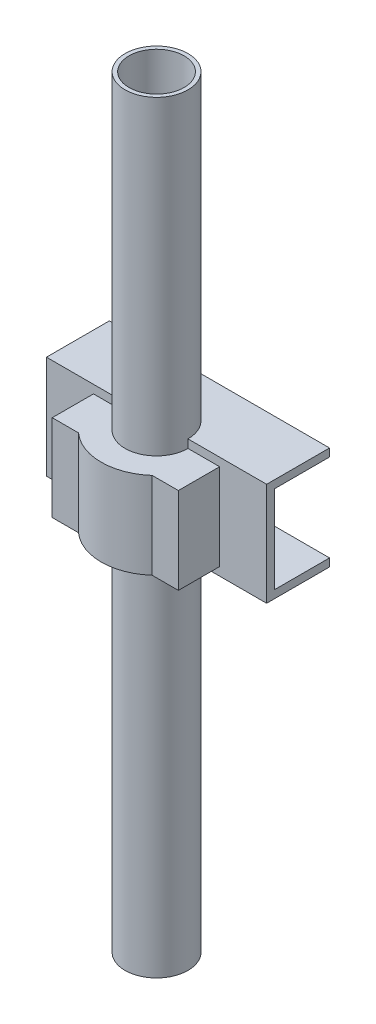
ISO-10303-21;
HEADER;
FILE_DESCRIPTION(('STEP AP214'),'2;1');
FILE_NAME('part.step','',(''),(''),'','','');
FILE_SCHEMA(('AUTOMOTIVE_DESIGN { 1 0 10303 214 1 1 1 1 }'));
ENDSEC;
DATA;
#1=APPLICATION_CONTEXT('core data for automotive mechanical design processes');
#2=APPLICATION_PROTOCOL_DEFINITION('international standard','automotive_design',2000,#1);
#3=PRODUCT_CONTEXT('',#1,'mechanical');
#4=PRODUCT('Part','Part','',(#3));
#5=PRODUCT_RELATED_PRODUCT_CATEGORY('part','',(#4));
#6=PRODUCT_DEFINITION_FORMATION('','',#4);
#7=PRODUCT_DEFINITION_CONTEXT('part definition',#1,'design');
#8=PRODUCT_DEFINITION('design','',#6,#7);
#9=PRODUCT_DEFINITION_SHAPE('','',#8);
#10=(LENGTH_UNIT() NAMED_UNIT(*) SI_UNIT(.MILLI.,.METRE.));
#11=(NAMED_UNIT(*) PLANE_ANGLE_UNIT() SI_UNIT($,.RADIAN.));
#12=(NAMED_UNIT(*) SI_UNIT($,.STERADIAN.) SOLID_ANGLE_UNIT());
#13=UNCERTAINTY_MEASURE_WITH_UNIT(LENGTH_MEASURE(1.E-05),#10,'distance_accuracy_value','');
#14=(GEOMETRIC_REPRESENTATION_CONTEXT(3) GLOBAL_UNCERTAINTY_ASSIGNED_CONTEXT((#13)) GLOBAL_UNIT_ASSIGNED_CONTEXT((#10,
#11,#12)) REPRESENTATION_CONTEXT('',''));
#15=CARTESIAN_POINT('',(0.,0.,0.));
#16=DIRECTION('',(0.,0.,1.));
#17=DIRECTION('',(1.,0.,0.));
#18=AXIS2_PLACEMENT_3D('',#15,#16,#17);
#19=CARTESIAN_POINT('',(14.,6.555,4.));
#20=DIRECTION('',(0.,0.,-1.));
#21=DIRECTION('',(0.,1.,0.));
#22=AXIS2_PLACEMENT_3D('',#19,#20,#21);
#23=PLANE('',#22);
#24=DIRECTION('',(-1.,0.,0.));
#25=VECTOR('',#24,1.);
#26=CARTESIAN_POINT('',(-8.02128804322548,5.5,4.));
#27=LINE('',#26,#25);
#28=CARTESIAN_POINT('',(-4.,5.49999999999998,4.00000000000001));
#29=VERTEX_POINT('',#28);
#30=CARTESIAN_POINT('',(-8.02128804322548,5.5,4.));
#31=VERTEX_POINT('',#30);
#32=EDGE_CURVE('E208',#29,#31,#27,.T.);
#33=ORIENTED_EDGE('',*,*,#32,.F.);
#34=DIRECTION('',(0.,1.,0.));
#35=VECTOR('',#34,1.);
#36=CARTESIAN_POINT('',(-4.,-52.,4.00000000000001));
#37=LINE('',#36,#35);
#38=CARTESIAN_POINT('',(-4.,6.55500000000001,4.));
#39=VERTEX_POINT('',#38);
#40=EDGE_CURVE('E237',#29,#39,#37,.T.);
#41=ORIENTED_EDGE('',*,*,#40,.T.);
#42=DIRECTION('',(-1.,0.,0.));
#43=VECTOR('',#42,1.);
#44=CARTESIAN_POINT('',(14.,6.555,4.));
#45=LINE('',#44,#43);
#46=CARTESIAN_POINT('',(-14.,6.555,4.));
#47=VERTEX_POINT('',#46);
#48=EDGE_CURVE('E280',#39,#47,#45,.T.);
#49=ORIENTED_EDGE('',*,*,#48,.T.);
#50=DIRECTION('',(0.,-1.,0.));
#51=VECTOR('',#50,1.);
#52=CARTESIAN_POINT('',(-14.,6.555,4.));
#53=LINE('',#52,#51);
#54=CARTESIAN_POINT('',(-14.,-6.555,4.));
#55=VERTEX_POINT('',#54);
#56=EDGE_CURVE('E243',#47,#55,#53,.T.);
#57=ORIENTED_EDGE('',*,*,#56,.T.);
#58=DIRECTION('',(-1.,0.,0.));
#59=VECTOR('',#58,1.);
#60=CARTESIAN_POINT('',(14.,-6.555,4.));
#61=LINE('',#60,#59);
#62=CARTESIAN_POINT('',(-4.,-6.555,4.00000000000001));
#63=VERTEX_POINT('',#62);
#64=EDGE_CURVE('E299',#63,#55,#61,.T.);
#65=ORIENTED_EDGE('',*,*,#64,.F.);
#66=CARTESIAN_POINT('',(-4.,-5.50000000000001,4.00000000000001));
#67=VERTEX_POINT('',#66);
#68=EDGE_CURVE('E238',#63,#67,#37,.T.);
#69=ORIENTED_EDGE('',*,*,#68,.T.);
#70=DIRECTION('',(-1.,0.,0.));
#71=VECTOR('',#70,1.);
#72=CARTESIAN_POINT('',(-8.02128804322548,-5.5,4.));
#73=LINE('',#72,#71);
#74=CARTESIAN_POINT('',(-8.02128804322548,-5.5,4.));
#75=VERTEX_POINT('',#74);
#76=EDGE_CURVE('E52',#67,#75,#73,.T.);
#77=ORIENTED_EDGE('',*,*,#76,.T.);
#78=DIRECTION('',(0.,-1.,0.));
#79=VECTOR('',#78,1.);
#80=CARTESIAN_POINT('',(-8.02128804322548,5.5,4.));
#81=LINE('',#80,#79);
#82=EDGE_CURVE('E47',#31,#75,#81,.T.);
#83=ORIENTED_EDGE('',*,*,#82,.F.);
#84=EDGE_LOOP('',(#33,#41,#49,#57,#65,#69,#77,#83));
#85=FACE_BOUND('',#84,.T.);
#86=ADVANCED_FACE('F33',(#85),#23,.F.);
#87=DIRECTION('',(-1.,0.,0.));
#88=VECTOR('',#87,1.);
#89=CARTESIAN_POINT('',(8.02128804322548,5.5,4.));
#90=LINE('',#89,#88);
#91=CARTESIAN_POINT('',(8.02128804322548,5.5,4.));
#92=VERTEX_POINT('',#91);
#93=CARTESIAN_POINT('',(4.,5.49999999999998,4.00000000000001));
#94=VERTEX_POINT('',#93);
#95=EDGE_CURVE('E202',#92,#94,#90,.T.);
#96=ORIENTED_EDGE('',*,*,#95,.F.);
#97=DIRECTION('',(0.,-1.,0.));
#98=VECTOR('',#97,1.);
#99=CARTESIAN_POINT('',(8.02128804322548,5.5,4.));
#100=LINE('',#99,#98);
#101=CARTESIAN_POINT('',(8.02128804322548,-5.5,4.));
#102=VERTEX_POINT('',#101);
#103=EDGE_CURVE('E219',#92,#102,#100,.T.);
#104=ORIENTED_EDGE('',*,*,#103,.T.);
#105=DIRECTION('',(-1.,0.,0.));
#106=VECTOR('',#105,1.);
#107=CARTESIAN_POINT('',(8.02128804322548,-5.5,4.));
#108=LINE('',#107,#106);
#109=CARTESIAN_POINT('',(4.,-5.5,4.));
#110=VERTEX_POINT('',#109);
#111=EDGE_CURVE('E186',#102,#110,#108,.T.);
#112=ORIENTED_EDGE('',*,*,#111,.T.);
#113=DIRECTION('',(0.,1.,0.));
#114=VECTOR('',#113,1.);
#115=CARTESIAN_POINT('',(4.,-52.,4.00000000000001));
#116=LINE('',#115,#114);
#117=CARTESIAN_POINT('',(4.,-6.555,4.00000000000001));
#118=VERTEX_POINT('',#117);
#119=EDGE_CURVE('E233',#110,#118,#116,.F.);
#120=ORIENTED_EDGE('',*,*,#119,.T.);
#121=CARTESIAN_POINT('',(14.,-6.555,4.));
#122=VERTEX_POINT('',#121);
#123=EDGE_CURVE('E40',#122,#118,#61,.T.);
#124=ORIENTED_EDGE('',*,*,#123,.F.);
#125=DIRECTION('',(0.,-1.,0.));
#126=VECTOR('',#125,1.);
#127=CARTESIAN_POINT('',(14.,6.555,4.));
#128=LINE('',#127,#126);
#129=CARTESIAN_POINT('',(14.,6.555,4.));
#130=VERTEX_POINT('',#129);
#131=EDGE_CURVE('E263',#130,#122,#128,.T.);
#132=ORIENTED_EDGE('',*,*,#131,.F.);
#133=CARTESIAN_POINT('',(4.,6.55500000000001,4.));
#134=VERTEX_POINT('',#133);
#135=EDGE_CURVE('E281',#130,#134,#45,.T.);
#136=ORIENTED_EDGE('',*,*,#135,.T.);
#137=EDGE_CURVE('E234',#134,#94,#116,.F.);
#138=ORIENTED_EDGE('',*,*,#137,.T.);
#139=EDGE_LOOP('',(#96,#104,#112,#120,#124,#132,#136,#138));
#140=FACE_BOUND('',#139,.T.);
#141=ADVANCED_FACE('F348',(#140),#23,.F.);
#142=CARTESIAN_POINT('',(0.,-52.,4.));
#143=DIRECTION('',(0.,1.,0.));
#144=DIRECTION('',(0.,0.,1.));
#145=AXIS2_PLACEMENT_3D('',#142,#143,#144);
#146=CYLINDRICAL_SURFACE('',#145,4.);
#147=CARTESIAN_POINT('',(0.,45.,4.));
#148=DIRECTION('',(0.,1.,0.));
#149=DIRECTION('',(0.,0.,1.));
#150=AXIS2_PLACEMENT_3D('',#147,#148,#149);
#151=CIRCLE('',#150,4.);
#152=CARTESIAN_POINT('',(0.,45.,8.));
#153=VERTEX_POINT('',#152);
#154=EDGE_CURVE('E227',#153,#153,#151,.T.);
#155=ORIENTED_EDGE('',*,*,#154,.F.);
#156=EDGE_LOOP('',(#155));
#157=FACE_BOUND('',#156,.T.);
#158=ORIENTED_EDGE('',*,*,#40,.F.);
#159=CARTESIAN_POINT('',(0.,5.5,4.));
#160=DIRECTION('',(0.,-1.,0.));
#161=DIRECTION('',(0.,0.,1.));
#162=AXIS2_PLACEMENT_3D('',#159,#160,#161);
#163=CIRCLE('',#162,4.);
#164=EDGE_CURVE('E205',#94,#29,#163,.T.);
#165=ORIENTED_EDGE('',*,*,#164,.F.);
#166=ORIENTED_EDGE('',*,*,#137,.F.);
#167=CARTESIAN_POINT('',(0.,6.55500000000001,4.));
#168=DIRECTION('',(0.,-1.,0.));
#169=DIRECTION('',(0.,0.,-1.));
#170=AXIS2_PLACEMENT_3D('',#167,#168,#169);
#171=CIRCLE('',#170,4.);
#172=EDGE_CURVE('E11',#39,#134,#171,.T.);
#173=ORIENTED_EDGE('',*,*,#172,.F.);
#174=EDGE_LOOP('',(#158,#165,#166,#173));
#175=FACE_BOUND('',#174,.T.);
#176=ADVANCED_FACE('F364',(#157,#175),#146,.T.);
#177=CARTESIAN_POINT('',(14.,-6.555,4.));
#178=DIRECTION('',(0.,1.,0.));
#179=DIRECTION('',(0.,0.,1.));
#180=AXIS2_PLACEMENT_3D('',#177,#178,#179);
#181=PLANE('',#180);
#182=ORIENTED_EDGE('',*,*,#123,.T.);
#183=CARTESIAN_POINT('',(0.,-6.555,4.));
#184=DIRECTION('',(0.,1.,0.));
#185=DIRECTION('',(0.,0.,1.));
#186=AXIS2_PLACEMENT_3D('',#183,#184,#185);
#187=CIRCLE('',#186,4.);
#188=EDGE_CURVE('E240',#118,#63,#187,.T.);
#189=ORIENTED_EDGE('',*,*,#188,.T.);
#190=ORIENTED_EDGE('',*,*,#64,.T.);
#191=DIRECTION('',(0.,0.,-1.));
#192=VECTOR('',#191,1.);
#193=CARTESIAN_POINT('',(-14.,-6.555,4.));
#194=LINE('',#193,#192);
#195=CARTESIAN_POINT('',(-14.,-6.555,-4.00000000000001));
#196=VERTEX_POINT('',#195);
#197=EDGE_CURVE('E246',#55,#196,#194,.T.);
#198=ORIENTED_EDGE('',*,*,#197,.T.);
#199=DIRECTION('',(-1.,0.,0.));
#200=VECTOR('',#199,1.);
#201=CARTESIAN_POINT('',(14.,-6.555,-4.00000000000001));
#202=LINE('',#201,#200);
#203=CARTESIAN_POINT('',(14.,-6.555,-4.00000000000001));
#204=VERTEX_POINT('',#203);
#205=EDGE_CURVE('E297',#204,#196,#202,.T.);
#206=ORIENTED_EDGE('',*,*,#205,.F.);
#207=DIRECTION('',(0.,0.,-1.));
#208=VECTOR('',#207,1.);
#209=CARTESIAN_POINT('',(14.,-6.555,4.));
#210=LINE('',#209,#208);
#211=EDGE_CURVE('E266',#122,#204,#210,.T.);
#212=ORIENTED_EDGE('',*,*,#211,.F.);
#213=EDGE_LOOP('',(#182,#189,#190,#198,#206,#212));
#214=FACE_BOUND('',#213,.T.);
#215=ADVANCED_FACE('F305',(#214),#181,.F.);
#216=CARTESIAN_POINT('',(14.,-6.555,-4.00000000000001));
#217=DIRECTION('',(0.,0.,1.));
#218=DIRECTION('',(0.,-1.,0.));
#219=AXIS2_PLACEMENT_3D('',#216,#217,#218);
#220=PLANE('',#219);
#221=DIRECTION('',(0.,1.,0.));
#222=VECTOR('',#221,1.);
#223=CARTESIAN_POINT('',(-14.,-6.555,-4.00000000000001));
#224=LINE('',#223,#222);
#225=CARTESIAN_POINT('',(-14.,-5.555,-4.));
#226=VERTEX_POINT('',#225);
#227=EDGE_CURVE('E248',#196,#226,#224,.T.);
#228=ORIENTED_EDGE('',*,*,#227,.T.);
#229=DIRECTION('',(-1.,0.,0.));
#230=VECTOR('',#229,1.);
#231=CARTESIAN_POINT('',(14.,-5.555,-4.));
#232=LINE('',#231,#230);
#233=CARTESIAN_POINT('',(14.,-5.555,-4.));
#234=VERTEX_POINT('',#233);
#235=EDGE_CURVE('E294',#234,#226,#232,.T.);
#236=ORIENTED_EDGE('',*,*,#235,.F.);
#237=DIRECTION('',(0.,1.,0.));
#238=VECTOR('',#237,1.);
#239=CARTESIAN_POINT('',(14.,-6.555,-4.00000000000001));
#240=LINE('',#239,#238);
#241=EDGE_CURVE('E268',#204,#234,#240,.T.);
#242=ORIENTED_EDGE('',*,*,#241,.F.);
#243=ORIENTED_EDGE('',*,*,#205,.T.);
#244=EDGE_LOOP('',(#228,#236,#242,#243));
#245=FACE_BOUND('',#244,.T.);
#246=ADVANCED_FACE('F342',(#245),#220,.F.);
#247=CARTESIAN_POINT('',(14.,-5.555,2.99999999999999));
#248=DIRECTION('',(0.,-1.,0.));
#249=DIRECTION('',(0.,0.,-1.));
#250=AXIS2_PLACEMENT_3D('',#247,#248,#249);
#251=PLANE('',#250);
#252=DIRECTION('',(0.,0.,1.));
#253=VECTOR('',#252,1.);
#254=CARTESIAN_POINT('',(-14.,-5.555,2.99999999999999));
#255=LINE('',#254,#253);
#256=CARTESIAN_POINT('',(-14.,-5.555,2.99999999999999));
#257=VERTEX_POINT('',#256);
#258=EDGE_CURVE('E250',#226,#257,#255,.T.);
#259=ORIENTED_EDGE('',*,*,#258,.T.);
#260=DIRECTION('',(-1.,0.,0.));
#261=VECTOR('',#260,1.);
#262=CARTESIAN_POINT('',(14.,-5.555,2.99999999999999));
#263=LINE('',#262,#261);
#264=CARTESIAN_POINT('',(14.,-5.555,2.99999999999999));
#265=VERTEX_POINT('',#264);
#266=EDGE_CURVE('E292',#265,#257,#263,.T.);
#267=ORIENTED_EDGE('',*,*,#266,.F.);
#268=DIRECTION('',(0.,0.,1.));
#269=VECTOR('',#268,1.);
#270=CARTESIAN_POINT('',(14.,-5.555,2.99999999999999));
#271=LINE('',#270,#269);
#272=EDGE_CURVE('E270',#234,#265,#271,.T.);
#273=ORIENTED_EDGE('',*,*,#272,.F.);
#274=ORIENTED_EDGE('',*,*,#235,.T.);
#275=EDGE_LOOP('',(#259,#267,#273,#274));
#276=FACE_BOUND('',#275,.T.);
#277=ADVANCED_FACE('F337',(#276),#251,.F.);
#278=CARTESIAN_POINT('',(14.,5.555,2.99999999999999));
#279=DIRECTION('',(0.,0.,1.));
#280=DIRECTION('',(0.,-1.,0.));
#281=AXIS2_PLACEMENT_3D('',#278,#279,#280);
#282=PLANE('',#281);
#283=DIRECTION('',(0.,1.,0.));
#284=VECTOR('',#283,1.);
#285=CARTESIAN_POINT('',(-14.,5.555,2.99999999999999));
#286=LINE('',#285,#284);
#287=CARTESIAN_POINT('',(-14.,5.555,2.99999999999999));
#288=VERTEX_POINT('',#287);
#289=EDGE_CURVE('E253',#257,#288,#286,.T.);
#290=ORIENTED_EDGE('',*,*,#289,.T.);
#291=DIRECTION('',(-1.,0.,0.));
#292=VECTOR('',#291,1.);
#293=CARTESIAN_POINT('',(14.,5.555,2.99999999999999));
#294=LINE('',#293,#292);
#295=CARTESIAN_POINT('',(14.,5.555,2.99999999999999));
#296=VERTEX_POINT('',#295);
#297=EDGE_CURVE('E290',#296,#288,#294,.T.);
#298=ORIENTED_EDGE('',*,*,#297,.F.);
#299=DIRECTION('',(0.,1.,0.));
#300=VECTOR('',#299,1.);
#301=CARTESIAN_POINT('',(14.,5.555,2.99999999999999));
#302=LINE('',#301,#300);
#303=EDGE_CURVE('E272',#265,#296,#302,.T.);
#304=ORIENTED_EDGE('',*,*,#303,.F.);
#305=ORIENTED_EDGE('',*,*,#266,.T.);
#306=EDGE_LOOP('',(#290,#298,#304,#305));
#307=FACE_BOUND('',#306,.T.);
#308=ADVANCED_FACE('F334',(#307),#282,.F.);
#309=CARTESIAN_POINT('',(14.,5.555,-4.));
#310=DIRECTION('',(0.,1.,0.));
#311=DIRECTION('',(0.,0.,1.));
#312=AXIS2_PLACEMENT_3D('',#309,#310,#311);
#313=PLANE('',#312);
#314=ORIENTED_EDGE('',*,*,#297,.T.);
#315=DIRECTION('',(0.,0.,-1.));
#316=VECTOR('',#315,1.);
#317=CARTESIAN_POINT('',(-14.,5.555,-4.));
#318=LINE('',#317,#316);
#319=CARTESIAN_POINT('',(-14.,5.555,-4.));
#320=VERTEX_POINT('',#319);
#321=EDGE_CURVE('E256',#288,#320,#318,.T.);
#322=ORIENTED_EDGE('',*,*,#321,.T.);
#323=DIRECTION('',(-1.,0.,0.));
#324=VECTOR('',#323,1.);
#325=CARTESIAN_POINT('',(14.,5.555,-4.));
#326=LINE('',#325,#324);
#327=CARTESIAN_POINT('',(14.,5.555,-4.));
#328=VERTEX_POINT('',#327);
#329=EDGE_CURVE('E287',#328,#320,#326,.T.);
#330=ORIENTED_EDGE('',*,*,#329,.F.);
#331=DIRECTION('',(0.,0.,-1.));
#332=VECTOR('',#331,1.);
#333=CARTESIAN_POINT('',(14.,5.555,-4.));
#334=LINE('',#333,#332);
#335=EDGE_CURVE('E274',#296,#328,#334,.T.);
#336=ORIENTED_EDGE('',*,*,#335,.F.);
#337=EDGE_LOOP('',(#314,#322,#330,#336));
#338=FACE_BOUND('',#337,.T.);
#339=ADVANCED_FACE('F330',(#338),#313,.F.);
#340=CARTESIAN_POINT('',(14.,5.555,-4.));
#341=DIRECTION('',(0.,0.,1.));
#342=DIRECTION('',(0.,-1.,0.));
#343=AXIS2_PLACEMENT_3D('',#340,#341,#342);
#344=PLANE('',#343);
#345=DIRECTION('',(0.,1.,0.));
#346=VECTOR('',#345,1.);
#347=CARTESIAN_POINT('',(-14.,5.555,-4.));
#348=LINE('',#347,#346);
#349=CARTESIAN_POINT('',(-14.,6.555,-4.));
#350=VERTEX_POINT('',#349);
#351=EDGE_CURVE('E258',#320,#350,#348,.T.);
#352=ORIENTED_EDGE('',*,*,#351,.T.);
#353=DIRECTION('',(-1.,0.,0.));
#354=VECTOR('',#353,1.);
#355=CARTESIAN_POINT('',(14.,6.555,-4.));
#356=LINE('',#355,#354);
#357=CARTESIAN_POINT('',(14.,6.555,-4.));
#358=VERTEX_POINT('',#357);
#359=EDGE_CURVE('E284',#358,#350,#356,.T.);
#360=ORIENTED_EDGE('',*,*,#359,.F.);
#361=DIRECTION('',(0.,1.,0.));
#362=VECTOR('',#361,1.);
#363=CARTESIAN_POINT('',(14.,5.555,-4.));
#364=LINE('',#363,#362);
#365=EDGE_CURVE('E276',#328,#358,#364,.T.);
#366=ORIENTED_EDGE('',*,*,#365,.F.);
#367=ORIENTED_EDGE('',*,*,#329,.T.);
#368=EDGE_LOOP('',(#352,#360,#366,#367));
#369=FACE_BOUND('',#368,.T.);
#370=ADVANCED_FACE('F325',(#369),#344,.F.);
#371=CARTESIAN_POINT('',(14.,6.555,-4.));
#372=DIRECTION('',(0.,-1.,0.));
#373=DIRECTION('',(0.,0.,-1.));
#374=AXIS2_PLACEMENT_3D('',#371,#372,#373);
#375=PLANE('',#374);
#376=ORIENTED_EDGE('',*,*,#48,.F.);
#377=ORIENTED_EDGE('',*,*,#172,.T.);
#378=ORIENTED_EDGE('',*,*,#135,.F.);
#379=DIRECTION('',(0.,0.,1.));
#380=VECTOR('',#379,1.);
#381=CARTESIAN_POINT('',(14.,6.555,-4.));
#382=LINE('',#381,#380);
#383=EDGE_CURVE('E278',#358,#130,#382,.T.);
#384=ORIENTED_EDGE('',*,*,#383,.F.);
#385=ORIENTED_EDGE('',*,*,#359,.T.);
#386=DIRECTION('',(0.,0.,1.));
#387=VECTOR('',#386,1.);
#388=CARTESIAN_POINT('',(-14.,6.555,-4.));
#389=LINE('',#388,#387);
#390=EDGE_CURVE('E260',#350,#47,#389,.T.);
#391=ORIENTED_EDGE('',*,*,#390,.T.);
#392=EDGE_LOOP('',(#376,#377,#378,#384,#385,#391));
#393=FACE_BOUND('',#392,.T.);
#394=ADVANCED_FACE('F318',(#393),#375,.F.);
#395=CARTESIAN_POINT('',(14.,-5.555,4.));
#396=DIRECTION('',(1.,0.,0.));
#397=DIRECTION('',(0.,0.,-1.));
#398=AXIS2_PLACEMENT_3D('',#395,#396,#397);
#399=PLANE('',#398);
#400=ORIENTED_EDGE('',*,*,#131,.T.);
#401=ORIENTED_EDGE('',*,*,#211,.T.);
#402=ORIENTED_EDGE('',*,*,#241,.T.);
#403=ORIENTED_EDGE('',*,*,#272,.T.);
#404=ORIENTED_EDGE('',*,*,#303,.T.);
#405=ORIENTED_EDGE('',*,*,#335,.T.);
#406=ORIENTED_EDGE('',*,*,#365,.T.);
#407=ORIENTED_EDGE('',*,*,#383,.T.);
#408=EDGE_LOOP('',(#400,#401,#402,#403,#404,#405,#406,#407));
#409=FACE_BOUND('',#408,.T.);
#410=ADVANCED_FACE('F345',(#409),#399,.T.);
#411=CARTESIAN_POINT('',(-14.,-5.555,4.));
#412=DIRECTION('',(1.,0.,0.));
#413=DIRECTION('',(0.,0.,-1.));
#414=AXIS2_PLACEMENT_3D('',#411,#412,#413);
#415=PLANE('',#414);
#416=ORIENTED_EDGE('',*,*,#56,.F.);
#417=ORIENTED_EDGE('',*,*,#390,.F.);
#418=ORIENTED_EDGE('',*,*,#351,.F.);
#419=ORIENTED_EDGE('',*,*,#321,.F.);
#420=ORIENTED_EDGE('',*,*,#289,.F.);
#421=ORIENTED_EDGE('',*,*,#258,.F.);
#422=ORIENTED_EDGE('',*,*,#227,.F.);
#423=ORIENTED_EDGE('',*,*,#197,.F.);
#424=EDGE_LOOP('',(#416,#417,#418,#419,#420,#421,#422,#423));
#425=FACE_BOUND('',#424,.T.);
#426=ADVANCED_FACE('F311',(#425),#415,.F.);
#427=CARTESIAN_POINT('',(0.,45.,4.));
#428=DIRECTION('',(0.,1.,0.));
#429=DIRECTION('',(0.,0.,1.));
#430=AXIS2_PLACEMENT_3D('',#427,#428,#429);
#431=PLANE('',#430);
#432=CARTESIAN_POINT('',(0.,45.,4.));
#433=DIRECTION('',(0.,1.,0.));
#434=DIRECTION('',(0.,0.,1.));
#435=AXIS2_PLACEMENT_3D('',#432,#433,#434);
#436=CIRCLE('',#435,3.5);
#437=CARTESIAN_POINT('',(0.,45.,7.5));
#438=VERTEX_POINT('',#437);
#439=EDGE_CURVE('E176',#438,#438,#436,.T.);
#440=ORIENTED_EDGE('',*,*,#439,.F.);
#441=EDGE_LOOP('',(#440));
#442=FACE_BOUND('',#441,.T.);
#443=ORIENTED_EDGE('',*,*,#154,.T.);
#444=EDGE_LOOP('',(#443));
#445=FACE_BOUND('',#444,.T.);
#446=ADVANCED_FACE('F402',(#442,#445),#431,.T.);
#447=CARTESIAN_POINT('',(0.,-52.,4.));
#448=DIRECTION('',(0.,1.,0.));
#449=DIRECTION('',(0.,0.,1.));
#450=AXIS2_PLACEMENT_3D('',#447,#448,#449);
#451=PLANE('',#450);
#452=CARTESIAN_POINT('',(0.,-52.,4.));
#453=DIRECTION('',(0.,1.,0.));
#454=DIRECTION('',(0.,0.,1.));
#455=AXIS2_PLACEMENT_3D('',#452,#453,#454);
#456=CIRCLE('',#455,4.);
#457=CARTESIAN_POINT('',(0.,-52.,8.));
#458=VERTEX_POINT('',#457);
#459=EDGE_CURVE('E230',#458,#458,#456,.T.);
#460=ORIENTED_EDGE('',*,*,#459,.F.);
#461=EDGE_LOOP('',(#460));
#462=FACE_BOUND('',#461,.T.);
#463=ADVANCED_FACE('F394',(#462),#451,.F.);
#464=CARTESIAN_POINT('',(0.,-5.5,4.));
#465=DIRECTION('',(0.,-1.,0.));
#466=DIRECTION('',(0.,0.,1.));
#467=AXIS2_PLACEMENT_3D('',#464,#465,#466);
#468=CIRCLE('',#467,4.);
#469=EDGE_CURVE('E189',#110,#67,#468,.T.);
#470=ORIENTED_EDGE('',*,*,#469,.T.);
#471=ORIENTED_EDGE('',*,*,#68,.F.);
#472=ORIENTED_EDGE('',*,*,#188,.F.);
#473=ORIENTED_EDGE('',*,*,#119,.F.);
#474=EDGE_LOOP('',(#470,#471,#472,#473));
#475=FACE_BOUND('',#474,.T.);
#476=ORIENTED_EDGE('',*,*,#459,.T.);
#477=EDGE_LOOP('',(#476));
#478=FACE_BOUND('',#477,.T.);
#479=ADVANCED_FACE('F351',(#475,#478),#146,.T.);
#480=CARTESIAN_POINT('',(14.,7.555,-4.));
#481=DIRECTION('',(0.,-1.,0.));
#482=DIRECTION('',(0.,0.,-1.));
#483=AXIS2_PLACEMENT_3D('',#480,#481,#482);
#484=PLANE('',#483);
#485=CARTESIAN_POINT('',(0.,7.555,4.));
#486=DIRECTION('',(0.,-1.,0.));
#487=DIRECTION('',(0.,0.,-1.));
#488=AXIS2_PLACEMENT_3D('',#485,#486,#487);
#489=CIRCLE('',#488,3.5);
#490=CARTESIAN_POINT('',(0.,7.555,0.5));
#491=VERTEX_POINT('',#490);
#492=EDGE_CURVE('E224',#491,#491,#489,.F.);
#493=ORIENTED_EDGE('',*,*,#492,.T.);
#494=EDGE_LOOP('',(#493));
#495=FACE_BOUND('',#494,.T.);
#496=ADVANCED_FACE('F393',(#495),#484,.F.);
#497=CARTESIAN_POINT('',(0.,-3.34449493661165,4.));
#498=DIRECTION('',(0.,1.,0.));
#499=DIRECTION('',(0.,0.,1.));
#500=AXIS2_PLACEMENT_3D('',#497,#498,#499);
#501=CYLINDRICAL_SURFACE('',#500,3.5);
#502=ORIENTED_EDGE('',*,*,#439,.T.);
#503=EDGE_LOOP('',(#502));
#504=FACE_BOUND('',#503,.T.);
#505=ORIENTED_EDGE('',*,*,#492,.F.);
#506=EDGE_LOOP('',(#505));
#507=FACE_BOUND('',#506,.T.);
#508=ADVANCED_FACE('F399',(#504,#507),#501,.F.);
#509=CARTESIAN_POINT('',(0.,5.5,4.));
#510=DIRECTION('',(0.,-1.,0.));
#511=DIRECTION('',(0.,0.,-1.));
#512=AXIS2_PLACEMENT_3D('',#509,#510,#511);
#513=CYLINDRICAL_SURFACE('',#512,7.03288657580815);
#514=CARTESIAN_POINT('',(0.,-5.5,4.));
#515=DIRECTION('',(0.,1.,0.));
#516=DIRECTION('',(0.,0.,-1.));
#517=AXIS2_PLACEMENT_3D('',#514,#515,#516);
#518=CIRCLE('',#517,7.03288657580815);
#519=CARTESIAN_POINT('',(-4.68468468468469,-5.5,9.24549549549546));
#520=VERTEX_POINT('',#519);
#521=CARTESIAN_POINT('',(4.68468468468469,-5.5,9.24549549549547));
#522=VERTEX_POINT('',#521);
#523=EDGE_CURVE('E161',#520,#522,#518,.T.);
#524=ORIENTED_EDGE('',*,*,#523,.T.);
#525=DIRECTION('',(0.,-1.,0.));
#526=VECTOR('',#525,1.);
#527=CARTESIAN_POINT('',(4.68468468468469,5.5,9.24549549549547));
#528=LINE('',#527,#526);
#529=CARTESIAN_POINT('',(4.68468468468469,5.5,9.24549549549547));
#530=VERTEX_POINT('',#529);
#531=EDGE_CURVE('E170',#530,#522,#528,.T.);
#532=ORIENTED_EDGE('',*,*,#531,.F.);
#533=CARTESIAN_POINT('',(0.,5.5,4.));
#534=DIRECTION('',(0.,1.,0.));
#535=DIRECTION('',(0.,0.,-1.));
#536=AXIS2_PLACEMENT_3D('',#533,#534,#535);
#537=CIRCLE('',#536,7.03288657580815);
#538=CARTESIAN_POINT('',(-4.68468468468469,5.5,9.24549549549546));
#539=VERTEX_POINT('',#538);
#540=EDGE_CURVE('E196',#539,#530,#537,.T.);
#541=ORIENTED_EDGE('',*,*,#540,.F.);
#542=DIRECTION('',(0.,-1.,0.));
#543=VECTOR('',#542,1.);
#544=CARTESIAN_POINT('',(-4.68468468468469,5.5,9.24549549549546));
#545=LINE('',#544,#543);
#546=EDGE_CURVE('E182',#539,#520,#545,.T.);
#547=ORIENTED_EDGE('',*,*,#546,.T.);
#548=EDGE_LOOP('',(#524,#532,#541,#547));
#549=FACE_BOUND('',#548,.T.);
#550=ADVANCED_FACE('F180',(#549),#513,.T.);
#551=CARTESIAN_POINT('',(8.02128804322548,5.5,9.24549549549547));
#552=DIRECTION('',(0.,0.,-1.));
#553=DIRECTION('',(-1.,0.,0.));
#554=AXIS2_PLACEMENT_3D('',#551,#552,#553);
#555=PLANE('',#554);
#556=DIRECTION('',(1.,0.,0.));
#557=VECTOR('',#556,1.);
#558=CARTESIAN_POINT('',(8.02128804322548,-5.5,9.24549549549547));
#559=LINE('',#558,#557);
#560=CARTESIAN_POINT('',(8.02128804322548,-5.5,9.24549549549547));
#561=VERTEX_POINT('',#560);
#562=EDGE_CURVE('E156',#522,#561,#559,.T.);
#563=ORIENTED_EDGE('',*,*,#562,.T.);
#564=DIRECTION('',(0.,-1.,0.));
#565=VECTOR('',#564,1.);
#566=CARTESIAN_POINT('',(8.02128804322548,5.5,9.24549549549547));
#567=LINE('',#566,#565);
#568=CARTESIAN_POINT('',(8.02128804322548,5.5,9.24549549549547));
#569=VERTEX_POINT('',#568);
#570=EDGE_CURVE('E177',#569,#561,#567,.T.);
#571=ORIENTED_EDGE('',*,*,#570,.F.);
#572=DIRECTION('',(1.,0.,0.));
#573=VECTOR('',#572,1.);
#574=CARTESIAN_POINT('',(8.02128804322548,5.5,9.24549549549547));
#575=LINE('',#574,#573);
#576=EDGE_CURVE('E172',#530,#569,#575,.T.);
#577=ORIENTED_EDGE('',*,*,#576,.F.);
#578=ORIENTED_EDGE('',*,*,#531,.T.);
#579=EDGE_LOOP('',(#563,#571,#577,#578));
#580=FACE_BOUND('',#579,.T.);
#581=ADVANCED_FACE('F171',(#580),#555,.F.);
#582=CARTESIAN_POINT('',(8.02128804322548,5.5,4.));
#583=DIRECTION('',(-1.,0.,0.));
#584=DIRECTION('',(0.,0.,1.));
#585=AXIS2_PLACEMENT_3D('',#582,#583,#584);
#586=PLANE('',#585);
#587=DIRECTION('',(0.,0.,-1.));
#588=VECTOR('',#587,1.);
#589=CARTESIAN_POINT('',(8.02128804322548,-5.5,4.));
#590=LINE('',#589,#588);
#591=EDGE_CURVE('E164',#561,#102,#590,.T.);
#592=ORIENTED_EDGE('',*,*,#591,.T.);
#593=ORIENTED_EDGE('',*,*,#103,.F.);
#594=DIRECTION('',(0.,0.,-1.));
#595=VECTOR('',#594,1.);
#596=CARTESIAN_POINT('',(8.02128804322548,5.5,4.));
#597=LINE('',#596,#595);
#598=EDGE_CURVE('E199',#569,#92,#597,.T.);
#599=ORIENTED_EDGE('',*,*,#598,.F.);
#600=ORIENTED_EDGE('',*,*,#570,.T.);
#601=EDGE_LOOP('',(#592,#593,#599,#600));
#602=FACE_BOUND('',#601,.T.);
#603=ADVANCED_FACE('F368',(#602),#586,.F.);
#604=CARTESIAN_POINT('',(-8.02128804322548,5.5,4.));
#605=DIRECTION('',(1.,0.,0.));
#606=DIRECTION('',(0.,0.,-1.));
#607=AXIS2_PLACEMENT_3D('',#604,#605,#606);
#608=PLANE('',#607);
#609=DIRECTION('',(0.,0.,1.));
#610=VECTOR('',#609,1.);
#611=CARTESIAN_POINT('',(-8.02128804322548,-5.5,4.));
#612=LINE('',#611,#610);
#613=CARTESIAN_POINT('',(-8.02128804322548,-5.5,9.24549549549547));
#614=VERTEX_POINT('',#613);
#615=EDGE_CURVE('E192',#75,#614,#612,.T.);
#616=ORIENTED_EDGE('',*,*,#615,.T.);
#617=DIRECTION('',(0.,-1.,0.));
#618=VECTOR('',#617,1.);
#619=CARTESIAN_POINT('',(-8.02128804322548,5.5,9.24549549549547));
#620=LINE('',#619,#618);
#621=CARTESIAN_POINT('',(-8.02128804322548,5.5,9.24549549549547));
#622=VERTEX_POINT('',#621);
#623=EDGE_CURVE('E215',#622,#614,#620,.T.);
#624=ORIENTED_EDGE('',*,*,#623,.F.);
#625=DIRECTION('',(0.,0.,1.));
#626=VECTOR('',#625,1.);
#627=CARTESIAN_POINT('',(-8.02128804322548,5.5,4.));
#628=LINE('',#627,#626);
#629=EDGE_CURVE('E210',#31,#622,#628,.T.);
#630=ORIENTED_EDGE('',*,*,#629,.F.);
#631=ORIENTED_EDGE('',*,*,#82,.T.);
#632=EDGE_LOOP('',(#616,#624,#630,#631));
#633=FACE_BOUND('',#632,.T.);
#634=ADVANCED_FACE('F356',(#633),#608,.F.);
#635=CARTESIAN_POINT('',(-8.02128804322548,5.5,9.24549549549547));
#636=DIRECTION('',(0.,0.,-1.));
#637=DIRECTION('',(-1.,0.,0.));
#638=AXIS2_PLACEMENT_3D('',#635,#636,#637);
#639=PLANE('',#638);
#640=DIRECTION('',(1.,0.,0.));
#641=VECTOR('',#640,1.);
#642=CARTESIAN_POINT('',(-8.02128804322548,-5.5,9.24549549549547));
#643=LINE('',#642,#641);
#644=EDGE_CURVE('E194',#614,#520,#643,.T.);
#645=ORIENTED_EDGE('',*,*,#644,.T.);
#646=ORIENTED_EDGE('',*,*,#546,.F.);
#647=DIRECTION('',(1.,0.,0.));
#648=VECTOR('',#647,1.);
#649=CARTESIAN_POINT('',(-8.02128804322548,5.5,9.24549549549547));
#650=LINE('',#649,#648);
#651=EDGE_CURVE('E212',#622,#539,#650,.T.);
#652=ORIENTED_EDGE('',*,*,#651,.F.);
#653=ORIENTED_EDGE('',*,*,#623,.T.);
#654=EDGE_LOOP('',(#645,#646,#652,#653));
#655=FACE_BOUND('',#654,.T.);
#656=ADVANCED_FACE('F360',(#655),#639,.F.);
#657=CARTESIAN_POINT('',(0.,5.5,4.));
#658=DIRECTION('',(0.,-1.,0.));
#659=DIRECTION('',(0.,0.,-1.));
#660=AXIS2_PLACEMENT_3D('',#657,#658,#659);
#661=PLANE('',#660);
#662=ORIENTED_EDGE('',*,*,#540,.T.);
#663=ORIENTED_EDGE('',*,*,#576,.T.);
#664=ORIENTED_EDGE('',*,*,#598,.T.);
#665=ORIENTED_EDGE('',*,*,#95,.T.);
#666=ORIENTED_EDGE('',*,*,#164,.T.);
#667=ORIENTED_EDGE('',*,*,#32,.T.);
#668=ORIENTED_EDGE('',*,*,#629,.T.);
#669=ORIENTED_EDGE('',*,*,#651,.T.);
#670=EDGE_LOOP('',(#662,#663,#664,#665,#666,#667,#668,#669));
#671=FACE_BOUND('',#670,.T.);
#672=ADVANCED_FACE('F362',(#671),#661,.F.);
#673=CARTESIAN_POINT('',(0.,-5.5,4.));
#674=DIRECTION('',(0.,-1.,0.));
#675=DIRECTION('',(0.,0.,-1.));
#676=AXIS2_PLACEMENT_3D('',#673,#674,#675);
#677=PLANE('',#676);
#678=ORIENTED_EDGE('',*,*,#523,.F.);
#679=ORIENTED_EDGE('',*,*,#644,.F.);
#680=ORIENTED_EDGE('',*,*,#615,.F.);
#681=ORIENTED_EDGE('',*,*,#76,.F.);
#682=ORIENTED_EDGE('',*,*,#469,.F.);
#683=ORIENTED_EDGE('',*,*,#111,.F.);
#684=ORIENTED_EDGE('',*,*,#591,.F.);
#685=ORIENTED_EDGE('',*,*,#562,.F.);
#686=EDGE_LOOP('',(#678,#679,#680,#681,#682,#683,#684,#685));
#687=FACE_BOUND('',#686,.T.);
#688=ADVANCED_FACE('F158',(#687),#677,.T.);
#689=CLOSED_SHELL('',(#86,#141,#176,#215,#246,#277,#308,#339,#370,#394,#410,#426,#446,#463,#479,
#496,#508,#550,#581,#603,#634,#656,#672,#688));
#690=MANIFOLD_SOLID_BREP('B2',#689);
#691=ADVANCED_BREP_SHAPE_REPRESENTATION('',(#18,#690),#14);
#692=SHAPE_DEFINITION_REPRESENTATION(#9,#691);
ENDSEC;
END-ISO-10303-21;
